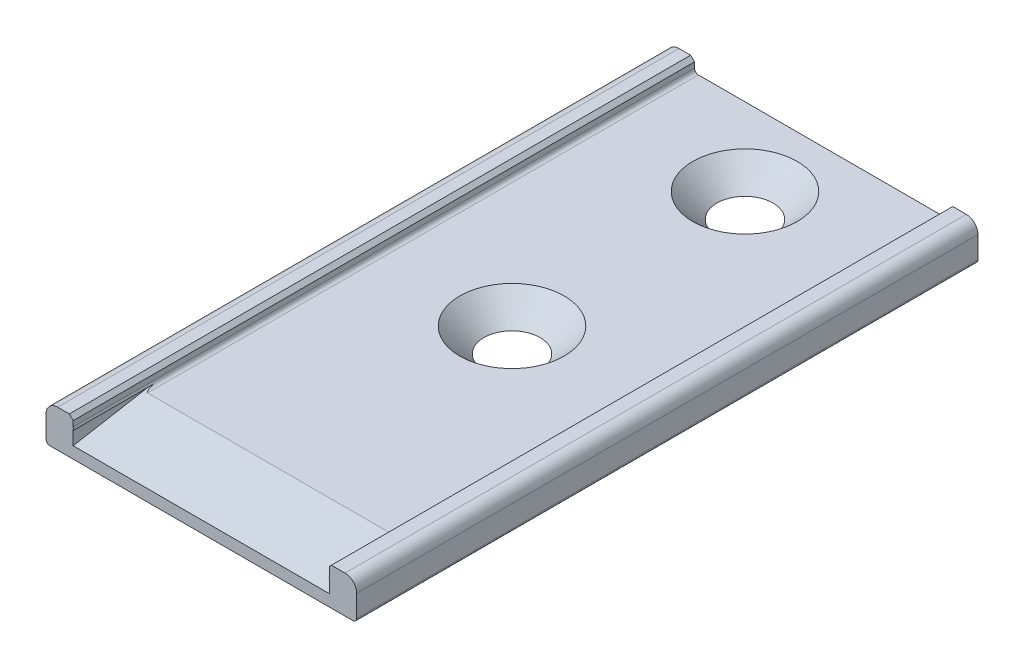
from build123d import *

# Parameters (mm, degrees)
BOSS_EXTRUDE1_DEPTH                                  = 80
CSK_FOR_M6_HEX_SOCKET_COUNTERSUNK_CAP_SC_D           = 6.6
CSK_FOR_M6_HEX_SOCKET_COUNTERSUNK_CAP_SC_DEPTH       = 38
CSK_FOR_M6_HEX_SOCKET_COUNTERSUNK_CAP_SC_CSINK_D     = 13.44
CSK_FOR_M6_HEX_SOCKET_COUNTERSUNK_CAP_SC_CSINK_ANGLE = 90
CSK_FOR_M6_HEX_SOCKET_COUNTERSUNK_CAP_SC_TIP         = 1.982840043
CUT_EXTRUDE1_DEPTH                                   = 16.5


with BuildPart() as part:
    # Sketch1 → Boss-Extrude1 (new body)
    with BuildSketch(Plane.XY):
        with BuildLine():
            Line((36.75, 4.8), (38.5, 4.8))
            ThreePointArc((38.5, 4.8), (39.560660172, 4.360660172), (40, 3.3))
            Line((40, 3.3), (40, 0.5))
            ThreePointArc((40, 0.5), (39.853553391, 0.146446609), (39.5, 0))
            Line((39.5, 0), (0.5, 0))
            ThreePointArc((0.5, 0), (0.146446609, 0.146446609), (0, 0.5))
            Line((0, 0.5), (0, 3.3))
            ThreePointArc((0, 3.3), (0.439339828, 4.360660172), (1.5, 4.8))
            Line((1.5, 4.8), (3, 4.8))
            Line((3, 4.8), (3.5, 4.3))
            Line((3.5, 4.3), (3.5, 3.6))
            ThreePointArc((3.5, 3.6), (3.646446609, 3.246446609), (4, 3.1))
            Line((4, 3.1), (36, 3.1))
            ThreePointArc((36, 3.1), (36.353553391, 3.246446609), (36.5, 3.6))
            Line((36.5, 3.6), (36.5, 4.55))
            Line((36.5, 4.55), (36.75, 4.8))
        make_face()
    extrude(amount=-BOSS_EXTRUDE1_DEPTH)

    # CSK for M6 Hex Socket Countersunk Cap Sc
    with Locations(Plane(origin=(0, 3.1, 0), x_dir=(1, 0, 0), z_dir=(0, 1, 0))):
        with Locations((20, 40), (20, 70)):
            CounterSinkHole(CSK_FOR_M6_HEX_SOCKET_COUNTERSUNK_CAP_SC_D / 2, CSK_FOR_M6_HEX_SOCKET_COUNTERSUNK_CAP_SC_CSINK_D / 2, depth=CSK_FOR_M6_HEX_SOCKET_COUNTERSUNK_CAP_SC_DEPTH, counter_sink_angle=CSK_FOR_M6_HEX_SOCKET_COUNTERSUNK_CAP_SC_CSINK_ANGLE)
            with Locations((0, 0, -(CSK_FOR_M6_HEX_SOCKET_COUNTERSUNK_CAP_SC_DEPTH + CSK_FOR_M6_HEX_SOCKET_COUNTERSUNK_CAP_SC_TIP / 2))):  # 118° drill point
                Cone(0, CSK_FOR_M6_HEX_SOCKET_COUNTERSUNK_CAP_SC_D / 2, CSK_FOR_M6_HEX_SOCKET_COUNTERSUNK_CAP_SC_TIP, mode=Mode.SUBTRACT)

    # Sketch5 → Cut-Extrude1 (cut, symmetric)
    with BuildSketch(Plane(origin=(20, 0, 0), x_dir=(0, 0, -1), z_dir=(1, 0, 0))):
        Polygon((0, 1.5), (10.208307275, 3.3), (-0.796147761, 3.3), (-0.796147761, 1.5), align=None)
    extrude(amount=CUT_EXTRUDE1_DEPTH, both=True, mode=Mode.SUBTRACT)


solid = part.part
